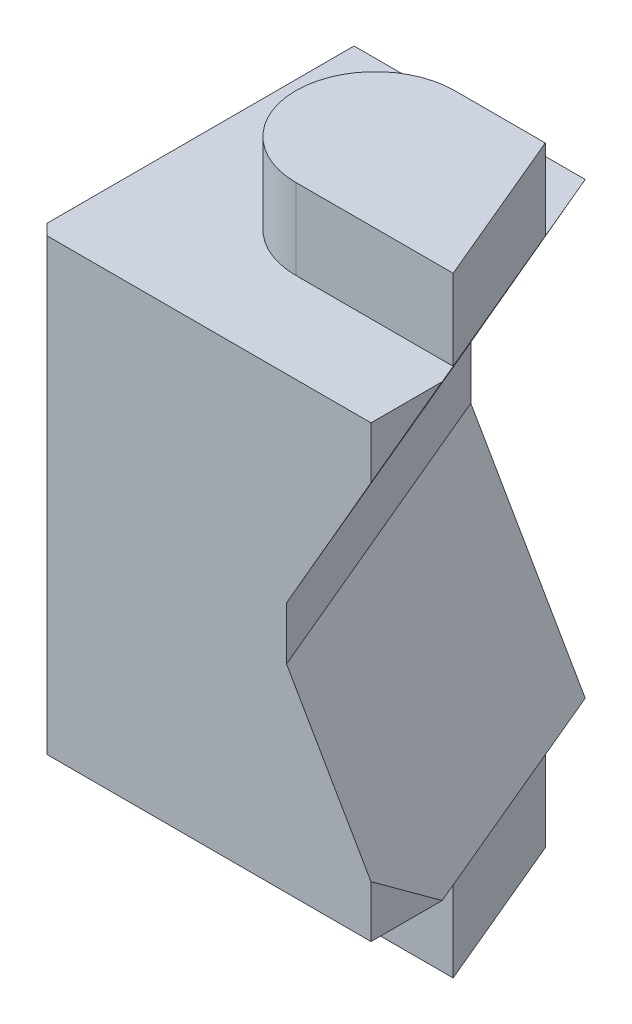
ISO-10303-21;
HEADER;
FILE_DESCRIPTION(('STEP AP214'),'2;1');
FILE_NAME('part.step','',(''),(''),'','','');
FILE_SCHEMA(('AUTOMOTIVE_DESIGN { 1 0 10303 214 1 1 1 1 }'));
ENDSEC;
DATA;
#1=APPLICATION_CONTEXT('core data for automotive mechanical design processes');
#2=APPLICATION_PROTOCOL_DEFINITION('international standard','automotive_design',2000,#1);
#3=PRODUCT_CONTEXT('',#1,'mechanical');
#4=PRODUCT('Part','Part','',(#3));
#5=PRODUCT_RELATED_PRODUCT_CATEGORY('part','',(#4));
#6=PRODUCT_DEFINITION_FORMATION('','',#4);
#7=PRODUCT_DEFINITION_CONTEXT('part definition',#1,'design');
#8=PRODUCT_DEFINITION('design','',#6,#7);
#9=PRODUCT_DEFINITION_SHAPE('','',#8);
#10=(LENGTH_UNIT() NAMED_UNIT(*) SI_UNIT(.MILLI.,.METRE.));
#11=(NAMED_UNIT(*) PLANE_ANGLE_UNIT() SI_UNIT($,.RADIAN.));
#12=(NAMED_UNIT(*) SI_UNIT($,.STERADIAN.) SOLID_ANGLE_UNIT());
#13=UNCERTAINTY_MEASURE_WITH_UNIT(LENGTH_MEASURE(1.E-05),#10,'distance_accuracy_value','');
#14=(GEOMETRIC_REPRESENTATION_CONTEXT(3) GLOBAL_UNCERTAINTY_ASSIGNED_CONTEXT((#13)) GLOBAL_UNIT_ASSIGNED_CONTEXT((#10,
#11,#12)) REPRESENTATION_CONTEXT('',''));
#15=CARTESIAN_POINT('',(0.,0.,0.));
#16=DIRECTION('',(0.,0.,1.));
#17=DIRECTION('',(1.,0.,0.));
#18=AXIS2_PLACEMENT_3D('',#15,#16,#17);
#19=CARTESIAN_POINT('',(-3.,0.,-7.5));
#20=DIRECTION('',(-1.,0.,0.));
#21=DIRECTION('',(0.,0.721350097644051,-0.692570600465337));
#22=AXIS2_PLACEMENT_3D('',#19,#20,#21);
#23=CYLINDRICAL_SURFACE('',#22,5.);
#24=CARTESIAN_POINT('',(-4.,0.,-7.5));
#25=DIRECTION('',(-1.,0.,0.));
#26=DIRECTION('',(0.,0.721350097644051,-0.692570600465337));
#27=AXIS2_PLACEMENT_3D('',#24,#25,#26);
#28=CIRCLE('',#27,5.);
#29=CARTESIAN_POINT('',(-4.00000000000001,3.60675048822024,-10.9628530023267));
#30=VERTEX_POINT('',#29);
#31=EDGE_CURVE('E282',#30,#30,#28,.T.);
#32=ORIENTED_EDGE('',*,*,#31,.T.);
#33=EDGE_LOOP('',(#32));
#34=FACE_BOUND('',#33,.T.);
#35=CARTESIAN_POINT('',(-4.6,0.,-7.5));
#36=DIRECTION('',(-1.,0.,0.));
#37=DIRECTION('',(0.,0.,1.));
#38=AXIS2_PLACEMENT_3D('',#35,#36,#37);
#39=CIRCLE('',#38,5.);
#40=CARTESIAN_POINT('',(-4.60000000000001,0.,-2.5));
#41=VERTEX_POINT('',#40);
#42=EDGE_CURVE('E284',#41,#41,#39,.T.);
#43=ORIENTED_EDGE('',*,*,#42,.F.);
#44=EDGE_LOOP('',(#43));
#45=FACE_BOUND('',#44,.T.);
#46=ADVANCED_FACE('F14',(#34,#45),#23,.T.);
#47=CARTESIAN_POINT('',(-2.99999999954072,0.,-7.5));
#48=DIRECTION('',(1.,0.,0.));
#49=DIRECTION('',(0.,-0.721350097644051,0.692570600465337));
#50=AXIS2_PLACEMENT_3D('',#47,#48,#49);
#51=CONICAL_SURFACE('',#50,5.99999999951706,0.785398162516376);
#52=CARTESIAN_POINT('',(-3.,0.,-7.5));
#53=DIRECTION('',(1.,0.,0.));
#54=DIRECTION('',(0.,0.,-1.));
#55=AXIS2_PLACEMENT_3D('',#52,#53,#54);
#56=CIRCLE('',#55,5.99999999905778);
#57=CARTESIAN_POINT('',(-3.,0.,-13.4999999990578));
#58=VERTEX_POINT('',#57);
#59=EDGE_CURVE('E9',#58,#58,#56,.T.);
#60=ORIENTED_EDGE('',*,*,#59,.F.);
#61=EDGE_LOOP('',(#60));
#62=FACE_BOUND('',#61,.T.);
#63=ORIENTED_EDGE('',*,*,#31,.F.);
#64=EDGE_LOOP('',(#63));
#65=FACE_BOUND('',#64,.T.);
#66=ADVANCED_FACE('F310',(#62,#65),#51,.T.);
#67=CARTESIAN_POINT('',(6.8,-14.4,-5.8));
#68=DIRECTION('',(0.,-1.,0.));
#69=DIRECTION('',(-1.,0.,0.));
#70=AXIS2_PLACEMENT_3D('',#67,#68,#69);
#71=PLANE('',#70);
#72=CARTESIAN_POINT('',(5.,-14.4,-8.));
#73=DIRECTION('',(0.,1.,0.));
#74=DIRECTION('',(-1.,0.,0.));
#75=AXIS2_PLACEMENT_3D('',#72,#73,#74);
#76=CIRCLE('',#75,3.75);
#77=CARTESIAN_POINT('',(5.,-14.4,-11.75));
#78=VERTEX_POINT('',#77);
#79=CARTESIAN_POINT('',(5.,-14.4,-4.25));
#80=VERTEX_POINT('',#79);
#81=EDGE_CURVE('E166',#78,#80,#76,.T.);
#82=ORIENTED_EDGE('',*,*,#81,.F.);
#83=DIRECTION('',(-1.,0.,0.));
#84=VECTOR('',#83,1.);
#85=CARTESIAN_POINT('',(5.,-14.4,-11.75));
#86=LINE('',#85,#84);
#87=CARTESIAN_POINT('',(9.27389168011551,-14.4,-11.75));
#88=VERTEX_POINT('',#87);
#89=EDGE_CURVE('E138',#88,#78,#86,.T.);
#90=ORIENTED_EDGE('',*,*,#89,.F.);
#91=DIRECTION('',(-0.387449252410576,0.,-0.921891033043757));
#92=VECTOR('',#91,1.);
#93=CARTESIAN_POINT('',(12.4259663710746,-14.4,-4.25));
#94=LINE('',#93,#92);
#95=CARTESIAN_POINT('',(12.4259663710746,-14.4,-4.25));
#96=VERTEX_POINT('',#95);
#97=EDGE_CURVE('E170',#96,#88,#94,.T.);
#98=ORIENTED_EDGE('',*,*,#97,.F.);
#99=DIRECTION('',(1.,0.,0.));
#100=VECTOR('',#99,1.);
#101=CARTESIAN_POINT('',(5.,-14.4,-4.25));
#102=LINE('',#101,#100);
#103=EDGE_CURVE('E153',#80,#96,#102,.T.);
#104=ORIENTED_EDGE('',*,*,#103,.F.);
#105=EDGE_LOOP('',(#82,#90,#98,#104));
#106=FACE_BOUND('',#105,.T.);
#107=ADVANCED_FACE('F312',(#106),#71,.T.);
#108=CARTESIAN_POINT('',(12.4259663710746,-10.6,-4.25));
#109=DIRECTION('',(-0.921891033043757,0.,0.387449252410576));
#110=DIRECTION('',(0.387449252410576,0.,0.921891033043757));
#111=AXIS2_PLACEMENT_3D('',#108,#109,#110);
#112=PLANE('',#111);
#113=ORIENTED_EDGE('',*,*,#97,.T.);
#114=DIRECTION('',(0.,-1.,0.));
#115=VECTOR('',#114,1.);
#116=CARTESIAN_POINT('',(9.2738916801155,-10.6,-11.75));
#117=LINE('',#116,#115);
#118=CARTESIAN_POINT('',(9.27389168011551,-10.6,-11.75));
#119=VERTEX_POINT('',#118);
#120=EDGE_CURVE('E142',#119,#88,#117,.T.);
#121=ORIENTED_EDGE('',*,*,#120,.F.);
#122=DIRECTION('',(-0.387449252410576,0.,-0.921891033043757));
#123=VECTOR('',#122,1.);
#124=CARTESIAN_POINT('',(12.4259663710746,-10.6,-4.25));
#125=LINE('',#124,#123);
#126=CARTESIAN_POINT('',(12.4259663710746,-10.6,-4.25));
#127=VERTEX_POINT('',#126);
#128=EDGE_CURVE('E160',#127,#119,#125,.T.);
#129=ORIENTED_EDGE('',*,*,#128,.F.);
#130=DIRECTION('',(0.,-1.,0.));
#131=VECTOR('',#130,1.);
#132=CARTESIAN_POINT('',(12.4259663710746,-10.6,-4.25));
#133=LINE('',#132,#131);
#134=EDGE_CURVE('E175',#127,#96,#133,.T.);
#135=ORIENTED_EDGE('',*,*,#134,.T.);
#136=EDGE_LOOP('',(#113,#121,#129,#135));
#137=FACE_BOUND('',#136,.T.);
#138=ADVANCED_FACE('F322',(#137),#112,.F.);
#139=CARTESIAN_POINT('',(12.4259663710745,10.6,-4.25));
#140=DIRECTION('',(0.921891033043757,0.,-0.387449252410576));
#141=DIRECTION('',(-0.387449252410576,0.,-0.921891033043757));
#142=AXIS2_PLACEMENT_3D('',#139,#140,#141);
#143=PLANE('',#142);
#144=DIRECTION('',(-0.387449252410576,0.,-0.921891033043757));
#145=VECTOR('',#144,1.);
#146=CARTESIAN_POINT('',(12.4259663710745,14.4,-4.25));
#147=LINE('',#146,#145);
#148=CARTESIAN_POINT('',(12.4259663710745,14.4,-4.25));
#149=VERTEX_POINT('',#148);
#150=CARTESIAN_POINT('',(9.27389168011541,14.4,-11.75));
#151=VERTEX_POINT('',#150);
#152=EDGE_CURVE('E196',#149,#151,#147,.T.);
#153=ORIENTED_EDGE('',*,*,#152,.F.);
#154=DIRECTION('',(0.,1.,0.));
#155=VECTOR('',#154,1.);
#156=CARTESIAN_POINT('',(12.4259663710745,10.6,-4.25));
#157=LINE('',#156,#155);
#158=CARTESIAN_POINT('',(12.4259663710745,10.6,-4.25));
#159=VERTEX_POINT('',#158);
#160=EDGE_CURVE('E206',#159,#149,#157,.T.);
#161=ORIENTED_EDGE('',*,*,#160,.F.);
#162=DIRECTION('',(-0.387449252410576,0.,-0.921891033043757));
#163=VECTOR('',#162,1.);
#164=CARTESIAN_POINT('',(12.4259663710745,10.6,-4.25));
#165=LINE('',#164,#163);
#166=CARTESIAN_POINT('',(9.27389168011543,10.6,-11.75));
#167=VERTEX_POINT('',#166);
#168=EDGE_CURVE('E184',#159,#167,#165,.T.);
#169=ORIENTED_EDGE('',*,*,#168,.T.);
#170=DIRECTION('',(0.,1.,0.));
#171=VECTOR('',#170,1.);
#172=CARTESIAN_POINT('',(9.27389168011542,10.6,-11.75));
#173=LINE('',#172,#171);
#174=EDGE_CURVE('E204',#167,#151,#173,.T.);
#175=ORIENTED_EDGE('',*,*,#174,.T.);
#176=EDGE_LOOP('',(#153,#161,#169,#175));
#177=FACE_BOUND('',#176,.T.);
#178=ADVANCED_FACE('F328',(#177),#143,.T.);
#179=CARTESIAN_POINT('',(4.98939776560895,14.4,-8.));
#180=DIRECTION('',(0.,1.,0.));
#181=DIRECTION('',(-1.,0.,0.));
#182=AXIS2_PLACEMENT_3D('',#179,#180,#181);
#183=PLANE('',#182);
#184=CARTESIAN_POINT('',(5.,14.4,-8.));
#185=DIRECTION('',(0.,1.,0.));
#186=DIRECTION('',(-1.,0.,0.));
#187=AXIS2_PLACEMENT_3D('',#184,#185,#186);
#188=CIRCLE('',#187,3.75);
#189=CARTESIAN_POINT('',(5.,14.4,-11.75));
#190=VERTEX_POINT('',#189);
#191=CARTESIAN_POINT('',(5.,14.4,-4.25));
#192=VERTEX_POINT('',#191);
#193=EDGE_CURVE('E174',#190,#192,#188,.T.);
#194=ORIENTED_EDGE('',*,*,#193,.T.);
#195=DIRECTION('',(1.,0.,0.));
#196=VECTOR('',#195,1.);
#197=CARTESIAN_POINT('',(5.,14.4,-4.25));
#198=LINE('',#197,#196);
#199=EDGE_CURVE('E193',#192,#149,#198,.T.);
#200=ORIENTED_EDGE('',*,*,#199,.T.);
#201=ORIENTED_EDGE('',*,*,#152,.T.);
#202=DIRECTION('',(-1.,0.,0.));
#203=VECTOR('',#202,1.);
#204=CARTESIAN_POINT('',(5.,14.4,-11.75));
#205=LINE('',#204,#203);
#206=EDGE_CURVE('E181',#151,#190,#205,.T.);
#207=ORIENTED_EDGE('',*,*,#206,.T.);
#208=EDGE_LOOP('',(#194,#200,#201,#207));
#209=FACE_BOUND('',#208,.T.);
#210=ADVANCED_FACE('F332',(#209),#183,.T.);
#211=CARTESIAN_POINT('',(5.,-10.6,-11.75));
#212=DIRECTION('',(0.,0.,1.));
#213=DIRECTION('',(1.,0.,0.));
#214=AXIS2_PLACEMENT_3D('',#211,#212,#213);
#215=PLANE('',#214);
#216=ORIENTED_EDGE('',*,*,#89,.T.);
#217=DIRECTION('',(0.,-1.,0.));
#218=VECTOR('',#217,1.);
#219=CARTESIAN_POINT('',(5.,-10.6,-11.75));
#220=LINE('',#219,#218);
#221=CARTESIAN_POINT('',(5.,-10.6,-11.75));
#222=VERTEX_POINT('',#221);
#223=EDGE_CURVE('E134',#222,#78,#220,.T.);
#224=ORIENTED_EDGE('',*,*,#223,.F.);
#225=DIRECTION('',(-1.,0.,0.));
#226=VECTOR('',#225,1.);
#227=CARTESIAN_POINT('',(5.,-10.6,-11.75));
#228=LINE('',#227,#226);
#229=EDGE_CURVE('E31',#119,#222,#228,.T.);
#230=ORIENTED_EDGE('',*,*,#229,.F.);
#231=ORIENTED_EDGE('',*,*,#120,.T.);
#232=EDGE_LOOP('',(#216,#224,#230,#231));
#233=FACE_BOUND('',#232,.T.);
#234=ADVANCED_FACE('F136',(#233),#215,.F.);
#235=CARTESIAN_POINT('',(12.8,0.,-7.35));
#236=DIRECTION('',(1.,0.,0.));
#237=DIRECTION('',(0.,1.,0.));
#238=AXIS2_PLACEMENT_3D('',#235,#236,#237);
#239=PLANE('',#238);
#240=DIRECTION('',(0.,0.,1.));
#241=VECTOR('',#240,1.);
#242=CARTESIAN_POINT('',(12.8,-10.6,-7.35));
#243=LINE('',#242,#241);
#244=CARTESIAN_POINT('',(12.8,-10.6,0.));
#245=VERTEX_POINT('',#244);
#246=CARTESIAN_POINT('',(12.8,-10.6,-3.36002990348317));
#247=VERTEX_POINT('',#246);
#248=EDGE_CURVE('E268',#245,#247,#243,.F.);
#249=ORIENTED_EDGE('',*,*,#248,.T.);
#250=DIRECTION('',(0.,-0.588524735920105,-0.808479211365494));
#251=VECTOR('',#250,1.);
#252=CARTESIAN_POINT('',(12.8,-8.15409825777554,0.));
#253=LINE('',#252,#251);
#254=CARTESIAN_POINT('',(12.8,-8.15409825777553,0.));
#255=VERTEX_POINT('',#254);
#256=EDGE_CURVE('E265',#255,#247,#253,.T.);
#257=ORIENTED_EDGE('',*,*,#256,.F.);
#258=DIRECTION('',(0.,1.,0.));
#259=VECTOR('',#258,1.);
#260=CARTESIAN_POINT('',(12.8,0.,0.));
#261=LINE('',#260,#259);
#262=EDGE_CURVE('E223',#245,#255,#261,.T.);
#263=ORIENTED_EDGE('',*,*,#262,.F.);
#264=EDGE_LOOP('',(#249,#257,#263));
#265=FACE_BOUND('',#264,.T.);
#266=ADVANCED_FACE('F352',(#265),#239,.T.);
#267=CARTESIAN_POINT('',(5.,-10.6,-4.25));
#268=DIRECTION('',(0.,0.,-1.));
#269=DIRECTION('',(-1.,0.,0.));
#270=AXIS2_PLACEMENT_3D('',#267,#268,#269);
#271=PLANE('',#270);
#272=ORIENTED_EDGE('',*,*,#103,.T.);
#273=ORIENTED_EDGE('',*,*,#134,.F.);
#274=DIRECTION('',(1.,0.,0.));
#275=VECTOR('',#274,1.);
#276=CARTESIAN_POINT('',(5.,-10.6,-4.25));
#277=LINE('',#276,#275);
#278=CARTESIAN_POINT('',(5.,-10.6,-4.25));
#279=VERTEX_POINT('',#278);
#280=EDGE_CURVE('E143',#279,#127,#277,.T.);
#281=ORIENTED_EDGE('',*,*,#280,.F.);
#282=DIRECTION('',(0.,-1.,0.));
#283=VECTOR('',#282,1.);
#284=CARTESIAN_POINT('',(5.,-10.6,-4.25));
#285=LINE('',#284,#283);
#286=EDGE_CURVE('E150',#279,#80,#285,.T.);
#287=ORIENTED_EDGE('',*,*,#286,.T.);
#288=EDGE_LOOP('',(#272,#273,#281,#287));
#289=FACE_BOUND('',#288,.T.);
#290=ADVANCED_FACE('F350',(#289),#271,.F.);
#291=CARTESIAN_POINT('',(5.,-10.6,-8.));
#292=DIRECTION('',(0.,-1.,0.));
#293=DIRECTION('',(1.,0.,0.));
#294=AXIS2_PLACEMENT_3D('',#291,#292,#293);
#295=CYLINDRICAL_SURFACE('',#294,3.75);
#296=ORIENTED_EDGE('',*,*,#81,.T.);
#297=ORIENTED_EDGE('',*,*,#286,.F.);
#298=CARTESIAN_POINT('',(5.,-10.6,-8.));
#299=DIRECTION('',(0.,1.,0.));
#300=DIRECTION('',(-1.,0.,0.));
#301=AXIS2_PLACEMENT_3D('',#298,#299,#300);
#302=CIRCLE('',#301,3.75);
#303=EDGE_CURVE('E147',#222,#279,#302,.T.);
#304=ORIENTED_EDGE('',*,*,#303,.F.);
#305=ORIENTED_EDGE('',*,*,#223,.T.);
#306=EDGE_LOOP('',(#296,#297,#304,#305));
#307=FACE_BOUND('',#306,.T.);
#308=ADVANCED_FACE('F148',(#307),#295,.T.);
#309=CARTESIAN_POINT('',(2.84556260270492,3.73713063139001,-7.35));
#310=DIRECTION('',(0.813797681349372,0.469846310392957,-0.342020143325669));
#311=DIRECTION('',(-0.5,0.866025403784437,0.));
#312=AXIS2_PLACEMENT_3D('',#309,#310,#311);
#313=PLANE('',#312);
#314=DIRECTION('',(-0.5,0.866025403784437,0.));
#315=VECTOR('',#314,1.);
#316=CARTESIAN_POINT('',(0.434225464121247,2.34494448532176,-15.));
#317=LINE('',#316,#315);
#318=CARTESIAN_POINT('',(7.90799264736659,-10.6,-15.));
#319=VERTEX_POINT('',#318);
#320=CARTESIAN_POINT('',(2.50847221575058,-1.2477562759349,-15.));
#321=VERTEX_POINT('',#320);
#322=EDGE_CURVE('E260',#319,#321,#317,.T.);
#323=ORIENTED_EDGE('',*,*,#322,.T.);
#324=DIRECTION('',(-0.387515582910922,0.000135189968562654,-0.921863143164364));
#325=VECTOR('',#324,1.);
#326=CARTESIAN_POINT('',(8.81389161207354,-1.24995600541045,0.));
#327=LINE('',#326,#325);
#328=CARTESIAN_POINT('',(8.81389161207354,-1.24995600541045,0.));
#329=VERTEX_POINT('',#328);
#330=EDGE_CURVE('E257',#329,#321,#327,.T.);
#331=ORIENTED_EDGE('',*,*,#330,.F.);
#332=DIRECTION('',(-0.5,0.866025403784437,0.));
#333=VECTOR('',#332,1.);
#334=CARTESIAN_POINT('',(12.8,-8.15409825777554,0.));
#335=LINE('',#334,#333);
#336=EDGE_CURVE('E220',#255,#329,#335,.T.);
#337=ORIENTED_EDGE('',*,*,#336,.F.);
#338=ORIENTED_EDGE('',*,*,#256,.T.);
#339=DIRECTION('',(-0.387449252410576,0.,-0.921891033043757));
#340=VECTOR('',#339,1.);
#341=CARTESIAN_POINT('',(12.8,-10.6,-3.36002990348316));
#342=LINE('',#341,#340);
#343=EDGE_CURVE('E262',#247,#127,#342,.T.);
#344=ORIENTED_EDGE('',*,*,#343,.T.);
#345=ORIENTED_EDGE('',*,*,#128,.T.);
#346=EDGE_CURVE('E158',#119,#319,#342,.T.);
#347=ORIENTED_EDGE('',*,*,#346,.T.);
#348=EDGE_LOOP('',(#323,#331,#337,#338,#344,#345,#347));
#349=FACE_BOUND('',#348,.T.);
#350=ADVANCED_FACE('F359',(#349),#313,.T.);
#351=CARTESIAN_POINT('',(5.72423610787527,5.925,-7.35));
#352=DIRECTION('',(0.921863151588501,0.,-0.387515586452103));
#353=DIRECTION('',(-0.387515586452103,0.,-0.921863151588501));
#354=AXIS2_PLACEMENT_3D('',#351,#352,#353);
#355=PLANE('',#354);
#356=DIRECTION('',(0.,1.,0.));
#357=VECTOR('',#356,1.);
#358=CARTESIAN_POINT('',(2.50847221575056,5.925,-15.));
#359=LINE('',#358,#357);
#360=CARTESIAN_POINT('',(2.50847221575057,1.24775627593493,-15.));
#361=VERTEX_POINT('',#360);
#362=EDGE_CURVE('E255',#321,#361,#359,.T.);
#363=ORIENTED_EDGE('',*,*,#362,.T.);
#364=DIRECTION('',(-0.387515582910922,-0.000135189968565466,-0.921863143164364));
#365=VECTOR('',#364,1.);
#366=CARTESIAN_POINT('',(8.81389161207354,1.24995600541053,0.));
#367=LINE('',#366,#365);
#368=CARTESIAN_POINT('',(8.81389161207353,1.24995600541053,0.));
#369=VERTEX_POINT('',#368);
#370=EDGE_CURVE('E252',#369,#361,#367,.T.);
#371=ORIENTED_EDGE('',*,*,#370,.F.);
#372=DIRECTION('',(0.,1.,0.));
#373=VECTOR('',#372,1.);
#374=CARTESIAN_POINT('',(8.81389161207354,0.,0.));
#375=LINE('',#374,#373);
#376=EDGE_CURVE('E217',#329,#369,#375,.T.);
#377=ORIENTED_EDGE('',*,*,#376,.F.);
#378=ORIENTED_EDGE('',*,*,#330,.T.);
#379=EDGE_LOOP('',(#363,#371,#377,#378));
#380=FACE_BOUND('',#379,.T.);
#381=ADVANCED_FACE('F377',(#380),#355,.T.);
#382=CARTESIAN_POINT('',(5.,10.6,-8.));
#383=DIRECTION('',(0.,1.,0.));
#384=DIRECTION('',(-1.,0.,0.));
#385=AXIS2_PLACEMENT_3D('',#382,#383,#384);
#386=CYLINDRICAL_SURFACE('',#385,3.75);
#387=ORIENTED_EDGE('',*,*,#193,.F.);
#388=DIRECTION('',(0.,1.,0.));
#389=VECTOR('',#388,1.);
#390=CARTESIAN_POINT('',(5.,10.6,-11.75));
#391=LINE('',#390,#389);
#392=CARTESIAN_POINT('',(5.,10.6,-11.75));
#393=VERTEX_POINT('',#392);
#394=EDGE_CURVE('E201',#393,#190,#391,.T.);
#395=ORIENTED_EDGE('',*,*,#394,.F.);
#396=CARTESIAN_POINT('',(5.,10.6,-8.));
#397=DIRECTION('',(0.,1.,0.));
#398=DIRECTION('',(-1.,0.,0.));
#399=AXIS2_PLACEMENT_3D('',#396,#397,#398);
#400=CIRCLE('',#399,3.75);
#401=CARTESIAN_POINT('',(5.,10.6,-4.25));
#402=VERTEX_POINT('',#401);
#403=EDGE_CURVE('E39',#393,#402,#400,.T.);
#404=ORIENTED_EDGE('',*,*,#403,.T.);
#405=DIRECTION('',(0.,1.,0.));
#406=VECTOR('',#405,1.);
#407=CARTESIAN_POINT('',(5.,10.6,-4.25));
#408=LINE('',#407,#406);
#409=EDGE_CURVE('E190',#402,#192,#408,.T.);
#410=ORIENTED_EDGE('',*,*,#409,.T.);
#411=EDGE_LOOP('',(#387,#395,#404,#410));
#412=FACE_BOUND('',#411,.T.);
#413=ADVANCED_FACE('F373',(#412),#386,.T.);
#414=CARTESIAN_POINT('',(5.,10.6,-4.25));
#415=DIRECTION('',(0.,0.,1.));
#416=DIRECTION('',(1.,0.,0.));
#417=AXIS2_PLACEMENT_3D('',#414,#415,#416);
#418=PLANE('',#417);
#419=ORIENTED_EDGE('',*,*,#199,.F.);
#420=ORIENTED_EDGE('',*,*,#409,.F.);
#421=DIRECTION('',(1.,0.,0.));
#422=VECTOR('',#421,1.);
#423=CARTESIAN_POINT('',(5.,10.6,-4.25));
#424=LINE('',#423,#422);
#425=EDGE_CURVE('E180',#402,#159,#424,.T.);
#426=ORIENTED_EDGE('',*,*,#425,.T.);
#427=ORIENTED_EDGE('',*,*,#160,.T.);
#428=EDGE_LOOP('',(#419,#420,#426,#427));
#429=FACE_BOUND('',#428,.T.);
#430=ADVANCED_FACE('F369',(#429),#418,.T.);
#431=CARTESIAN_POINT('',(12.8,0.,-7.35));
#432=DIRECTION('',(1.,0.,0.));
#433=DIRECTION('',(0.,1.,0.));
#434=AXIS2_PLACEMENT_3D('',#431,#432,#433);
#435=PLANE('',#434);
#436=DIRECTION('',(0.,0.588524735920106,-0.808479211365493));
#437=VECTOR('',#436,1.);
#438=CARTESIAN_POINT('',(12.8,8.15409825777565,0.));
#439=LINE('',#438,#437);
#440=CARTESIAN_POINT('',(12.8,8.15409825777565,0.));
#441=VERTEX_POINT('',#440);
#442=CARTESIAN_POINT('',(12.8,10.6,-3.36002990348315));
#443=VERTEX_POINT('',#442);
#444=EDGE_CURVE('E247',#441,#443,#439,.T.);
#445=ORIENTED_EDGE('',*,*,#444,.T.);
#446=DIRECTION('',(0.,0.,1.));
#447=VECTOR('',#446,1.);
#448=CARTESIAN_POINT('',(12.8,10.6,0.3));
#449=LINE('',#448,#447);
#450=CARTESIAN_POINT('',(12.8,10.6,0.));
#451=VERTEX_POINT('',#450);
#452=EDGE_CURVE('E241',#451,#443,#449,.F.);
#453=ORIENTED_EDGE('',*,*,#452,.F.);
#454=DIRECTION('',(0.,1.,0.));
#455=VECTOR('',#454,1.);
#456=CARTESIAN_POINT('',(12.8,0.,0.));
#457=LINE('',#456,#455);
#458=EDGE_CURVE('E211',#441,#451,#457,.T.);
#459=ORIENTED_EDGE('',*,*,#458,.F.);
#460=EDGE_LOOP('',(#445,#453,#459));
#461=FACE_BOUND('',#460,.T.);
#462=ADVANCED_FACE('F372',(#461),#435,.T.);
#463=CARTESIAN_POINT('',(6.0259326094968,0.,0.));
#464=DIRECTION('',(0.,0.,1.));
#465=DIRECTION('',(1.,0.,0.));
#466=AXIS2_PLACEMENT_3D('',#463,#464,#465);
#467=PLANE('',#466);
#468=ORIENTED_EDGE('',*,*,#458,.T.);
#469=DIRECTION('',(1.,0.,0.));
#470=VECTOR('',#469,1.);
#471=CARTESIAN_POINT('',(6.02593260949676,10.6,0.));
#472=LINE('',#471,#470);
#473=CARTESIAN_POINT('',(-2.50000000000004,10.6,0.));
#474=VERTEX_POINT('',#473);
#475=EDGE_CURVE('E23',#451,#474,#472,.F.);
#476=ORIENTED_EDGE('',*,*,#475,.T.);
#477=DIRECTION('',(0.,1.,0.));
#478=VECTOR('',#477,1.);
#479=CARTESIAN_POINT('',(-2.5,0.,0.));
#480=LINE('',#479,#478);
#481=CARTESIAN_POINT('',(-2.49999999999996,-10.6,0.));
#482=VERTEX_POINT('',#481);
#483=EDGE_CURVE('E229',#474,#482,#480,.F.);
#484=ORIENTED_EDGE('',*,*,#483,.T.);
#485=DIRECTION('',(1.,0.,0.));
#486=VECTOR('',#485,1.);
#487=CARTESIAN_POINT('',(6.02593260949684,-10.6,0.));
#488=LINE('',#487,#486);
#489=EDGE_CURVE('E226',#482,#245,#488,.T.);
#490=ORIENTED_EDGE('',*,*,#489,.T.);
#491=ORIENTED_EDGE('',*,*,#262,.T.);
#492=ORIENTED_EDGE('',*,*,#336,.T.);
#493=ORIENTED_EDGE('',*,*,#376,.T.);
#494=DIRECTION('',(0.5,0.866025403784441,0.));
#495=VECTOR('',#494,1.);
#496=CARTESIAN_POINT('',(8.81389161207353,1.24995600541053,0.));
#497=LINE('',#496,#495);
#498=EDGE_CURVE('E214',#369,#441,#497,.T.);
#499=ORIENTED_EDGE('',*,*,#498,.T.);
#500=EDGE_LOOP('',(#468,#476,#484,#490,#491,#492,#493,#499));
#501=FACE_BOUND('',#500,.T.);
#502=ADVANCED_FACE('F379',(#501),#467,.T.);
#503=CARTESIAN_POINT('',(9.36549724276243,7.55572742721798,-7.35));
#504=DIRECTION('',(0.813797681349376,-0.469846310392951,-0.342020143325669));
#505=DIRECTION('',(0.5,0.866025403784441,0.));
#506=AXIS2_PLACEMENT_3D('',#503,#504,#505);
#507=PLANE('',#506);
#508=DIRECTION('',(-0.387449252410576,0.,-0.921891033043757));
#509=VECTOR('',#508,1.);
#510=CARTESIAN_POINT('',(12.8,10.6,-3.36002990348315));
#511=LINE('',#510,#509);
#512=EDGE_CURVE('E238',#443,#159,#511,.T.);
#513=ORIENTED_EDGE('',*,*,#512,.F.);
#514=ORIENTED_EDGE('',*,*,#444,.F.);
#515=ORIENTED_EDGE('',*,*,#498,.F.);
#516=ORIENTED_EDGE('',*,*,#370,.T.);
#517=DIRECTION('',(0.5,0.866025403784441,0.));
#518=VECTOR('',#517,1.);
#519=CARTESIAN_POINT('',(6.95416010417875,8.94791357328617,-15.));
#520=LINE('',#519,#518);
#521=CARTESIAN_POINT('',(7.9079926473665,10.6,-15.));
#522=VERTEX_POINT('',#521);
#523=EDGE_CURVE('E249',#361,#522,#520,.T.);
#524=ORIENTED_EDGE('',*,*,#523,.T.);
#525=EDGE_CURVE('E240',#167,#522,#511,.T.);
#526=ORIENTED_EDGE('',*,*,#525,.F.);
#527=ORIENTED_EDGE('',*,*,#168,.F.);
#528=EDGE_LOOP('',(#513,#514,#515,#516,#524,#526,#527));
#529=FACE_BOUND('',#528,.T.);
#530=ADVANCED_FACE('F364',(#529),#507,.T.);
#531=CARTESIAN_POINT('',(5.,10.6,-11.75));
#532=DIRECTION('',(0.,0.,-1.));
#533=DIRECTION('',(-1.,0.,0.));
#534=AXIS2_PLACEMENT_3D('',#531,#532,#533);
#535=PLANE('',#534);
#536=ORIENTED_EDGE('',*,*,#206,.F.);
#537=ORIENTED_EDGE('',*,*,#174,.F.);
#538=DIRECTION('',(-1.,0.,0.));
#539=VECTOR('',#538,1.);
#540=CARTESIAN_POINT('',(5.,10.6,-11.75));
#541=LINE('',#540,#539);
#542=EDGE_CURVE('E187',#167,#393,#541,.T.);
#543=ORIENTED_EDGE('',*,*,#542,.T.);
#544=ORIENTED_EDGE('',*,*,#394,.T.);
#545=EDGE_LOOP('',(#536,#537,#543,#544));
#546=FACE_BOUND('',#545,.T.);
#547=ADVANCED_FACE('F360',(#546),#535,.T.);
#548=CARTESIAN_POINT('',(-2.75,0.,-0.25));
#549=DIRECTION('',(-0.707106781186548,0.,0.707106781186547));
#550=DIRECTION('',(0.707106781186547,0.,0.707106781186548));
#551=AXIS2_PLACEMENT_3D('',#548,#549,#550);
#552=PLANE('',#551);
#553=DIRECTION('',(0.707106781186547,0.,0.707106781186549));
#554=VECTOR('',#553,1.);
#555=CARTESIAN_POINT('',(-3.00000000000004,10.6,-0.5));
#556=LINE('',#555,#554);
#557=CARTESIAN_POINT('',(-3.00000000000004,10.6,-0.5));
#558=VERTEX_POINT('',#557);
#559=EDGE_CURVE('E244',#558,#474,#556,.T.);
#560=ORIENTED_EDGE('',*,*,#559,.F.);
#561=DIRECTION('',(0.,1.,0.));
#562=VECTOR('',#561,1.);
#563=CARTESIAN_POINT('',(-3.,0.,-0.5));
#564=LINE('',#563,#562);
#565=CARTESIAN_POINT('',(-2.99999999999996,-10.6,-0.5));
#566=VERTEX_POINT('',#565);
#567=EDGE_CURVE('E278',#558,#566,#564,.F.);
#568=ORIENTED_EDGE('',*,*,#567,.T.);
#569=DIRECTION('',(-0.707106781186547,0.,-0.707106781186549));
#570=VECTOR('',#569,1.);
#571=CARTESIAN_POINT('',(-2.49999999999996,-10.6,0.));
#572=LINE('',#571,#570);
#573=EDGE_CURVE('E275',#482,#566,#572,.T.);
#574=ORIENTED_EDGE('',*,*,#573,.F.);
#575=ORIENTED_EDGE('',*,*,#483,.F.);
#576=EDGE_LOOP('',(#560,#568,#574,#575));
#577=FACE_BOUND('',#576,.T.);
#578=ADVANCED_FACE('F363',(#577),#552,.T.);
#579=CARTESIAN_POINT('',(0.,-10.6,-15.));
#580=DIRECTION('',(0.,-1.,0.));
#581=DIRECTION('',(1.,0.,0.));
#582=AXIS2_PLACEMENT_3D('',#579,#580,#581);
#583=PLANE('',#582);
#584=ORIENTED_EDGE('',*,*,#303,.T.);
#585=ORIENTED_EDGE('',*,*,#280,.T.);
#586=ORIENTED_EDGE('',*,*,#343,.F.);
#587=ORIENTED_EDGE('',*,*,#248,.F.);
#588=ORIENTED_EDGE('',*,*,#489,.F.);
#589=ORIENTED_EDGE('',*,*,#573,.T.);
#590=DIRECTION('',(0.,0.,1.));
#591=VECTOR('',#590,1.);
#592=CARTESIAN_POINT('',(-2.99999999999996,-10.6,-15.));
#593=LINE('',#592,#591);
#594=CARTESIAN_POINT('',(-2.99999999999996,-10.6,-15.));
#595=VERTEX_POINT('',#594);
#596=EDGE_CURVE('E272',#566,#595,#593,.F.);
#597=ORIENTED_EDGE('',*,*,#596,.T.);
#598=DIRECTION('',(1.,0.,0.));
#599=VECTOR('',#598,1.);
#600=CARTESIAN_POINT('',(0.,-10.6,-15.));
#601=LINE('',#600,#599);
#602=EDGE_CURVE('E270',#595,#319,#601,.T.);
#603=ORIENTED_EDGE('',*,*,#602,.T.);
#604=ORIENTED_EDGE('',*,*,#346,.F.);
#605=ORIENTED_EDGE('',*,*,#229,.T.);
#606=EDGE_LOOP('',(#584,#585,#586,#587,#588,#589,#597,#603,#604,#605));
#607=FACE_BOUND('',#606,.T.);
#608=ADVANCED_FACE('F156',(#607),#583,.T.);
#609=CARTESIAN_POINT('',(0.,10.6,-15.));
#610=DIRECTION('',(0.,0.,-1.));
#611=DIRECTION('',(-1.,0.,0.));
#612=AXIS2_PLACEMENT_3D('',#609,#610,#611);
#613=PLANE('',#612);
#614=DIRECTION('',(0.,1.,0.));
#615=VECTOR('',#614,1.);
#616=CARTESIAN_POINT('',(-3.,0.,-15.));
#617=LINE('',#616,#615);
#618=CARTESIAN_POINT('',(-3.00000000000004,10.6,-15.));
#619=VERTEX_POINT('',#618);
#620=EDGE_CURVE('E203',#595,#619,#617,.T.);
#621=ORIENTED_EDGE('',*,*,#620,.T.);
#622=DIRECTION('',(-1.,0.,0.));
#623=VECTOR('',#622,1.);
#624=CARTESIAN_POINT('',(0.,10.6,-15.));
#625=LINE('',#624,#623);
#626=EDGE_CURVE('E235',#522,#619,#625,.T.);
#627=ORIENTED_EDGE('',*,*,#626,.F.);
#628=ORIENTED_EDGE('',*,*,#523,.F.);
#629=ORIENTED_EDGE('',*,*,#362,.F.);
#630=ORIENTED_EDGE('',*,*,#322,.F.);
#631=ORIENTED_EDGE('',*,*,#602,.F.);
#632=EDGE_LOOP('',(#621,#627,#628,#629,#630,#631));
#633=FACE_BOUND('',#632,.T.);
#634=ADVANCED_FACE('F385',(#633),#613,.T.);
#635=CARTESIAN_POINT('',(0.,10.6,0.3));
#636=DIRECTION('',(0.,1.,0.));
#637=DIRECTION('',(-1.,0.,0.));
#638=AXIS2_PLACEMENT_3D('',#635,#636,#637);
#639=PLANE('',#638);
#640=ORIENTED_EDGE('',*,*,#542,.F.);
#641=ORIENTED_EDGE('',*,*,#525,.T.);
#642=ORIENTED_EDGE('',*,*,#626,.T.);
#643=DIRECTION('',(0.,0.,1.));
#644=VECTOR('',#643,1.);
#645=CARTESIAN_POINT('',(-3.00000000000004,10.6,0.3));
#646=LINE('',#645,#644);
#647=EDGE_CURVE('E232',#619,#558,#646,.T.);
#648=ORIENTED_EDGE('',*,*,#647,.T.);
#649=ORIENTED_EDGE('',*,*,#559,.T.);
#650=ORIENTED_EDGE('',*,*,#475,.F.);
#651=ORIENTED_EDGE('',*,*,#452,.T.);
#652=ORIENTED_EDGE('',*,*,#512,.T.);
#653=ORIENTED_EDGE('',*,*,#425,.F.);
#654=ORIENTED_EDGE('',*,*,#403,.F.);
#655=EDGE_LOOP('',(#640,#641,#642,#648,#649,#650,#651,#652,#653,#654));
#656=FACE_BOUND('',#655,.T.);
#657=ADVANCED_FACE('F346',(#656),#639,.T.);
#658=CARTESIAN_POINT('',(-3.,0.,-7.5));
#659=DIRECTION('',(1.,0.,0.));
#660=DIRECTION('',(0.,1.,0.));
#661=AXIS2_PLACEMENT_3D('',#658,#659,#660);
#662=PLANE('',#661);
#663=ORIENTED_EDGE('',*,*,#59,.T.);
#664=EDGE_LOOP('',(#663));
#665=FACE_BOUND('',#664,.T.);
#666=ORIENTED_EDGE('',*,*,#647,.F.);
#667=ORIENTED_EDGE('',*,*,#620,.F.);
#668=ORIENTED_EDGE('',*,*,#596,.F.);
#669=ORIENTED_EDGE('',*,*,#567,.F.);
#670=EDGE_LOOP('',(#666,#667,#668,#669));
#671=FACE_BOUND('',#670,.T.);
#672=ADVANCED_FACE('F318',(#665,#671),#662,.F.);
#673=CARTESIAN_POINT('',(-4.6,0.,-7.5));
#674=DIRECTION('',(-1.,0.,0.));
#675=DIRECTION('',(0.,0.,1.));
#676=AXIS2_PLACEMENT_3D('',#673,#674,#675);
#677=PLANE('',#676);
#678=CARTESIAN_POINT('',(-4.6,0.,-7.5));
#679=DIRECTION('',(-1.,0.,0.));
#680=DIRECTION('',(0.,0.,1.));
#681=AXIS2_PLACEMENT_3D('',#678,#679,#680);
#682=CIRCLE('',#681,4.25);
#683=CARTESIAN_POINT('',(-4.60000000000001,0.,-3.25));
#684=VERTEX_POINT('',#683);
#685=EDGE_CURVE('E288',#684,#684,#682,.T.);
#686=ORIENTED_EDGE('',*,*,#685,.F.);
#687=EDGE_LOOP('',(#686));
#688=FACE_BOUND('',#687,.T.);
#689=ORIENTED_EDGE('',*,*,#42,.T.);
#690=EDGE_LOOP('',(#689));
#691=FACE_BOUND('',#690,.T.);
#692=ADVANCED_FACE('F317',(#688,#691),#677,.T.);
#693=CARTESIAN_POINT('',(-3.24967305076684,0.,-7.5));
#694=DIRECTION('',(-1.,0.,0.));
#695=DIRECTION('',(0.,-0.707106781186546,-0.707106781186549));
#696=AXIS2_PLACEMENT_3D('',#693,#694,#695);
#697=SPHERICAL_SURFACE('',#696,4.25);
#698=CARTESIAN_POINT('',(-3.25,0.,-7.5));
#699=DIRECTION('',(-1.,0.,0.));
#700=DIRECTION('',(0.,0.,1.));
#701=AXIS2_PLACEMENT_3D('',#698,#699,#700);
#702=CIRCLE('',#701,4.24999998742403);
#703=CARTESIAN_POINT('',(-3.24999999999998,-3.00520381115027,-10.5052038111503));
#704=VERTEX_POINT('',#703);
#705=EDGE_CURVE('E168',#704,#704,#702,.F.);
#706=CARTESIAN_POINT('',(-6.,0.,-7.5));
#707=DIRECTION('',(1.,0.,0.));
#708=DIRECTION('',(0.,0.,-1.));
#709=AXIS2_PLACEMENT_3D('',#706,#707,#708);
#710=CIRCLE('',#709,3.24009284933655);
#711=CARTESIAN_POINT('',(-5.99999999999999,-2.29109162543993,-9.79109162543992));
#712=VERTEX_POINT('',#711);
#713=EDGE_CURVE('E292',#712,#712,#710,.T.);
#714=CARTESIAN_POINT('',(-3.24999999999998,-3.00520381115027,-10.5052038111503));
#715=CARTESIAN_POINT('',(-3.28115535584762,-3.00520215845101,-10.505202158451));
#716=CARTESIAN_POINT('',(-3.31231068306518,-3.00495817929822,-10.5049581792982));
#717=CARTESIAN_POINT('',(-3.37460621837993,-3.00398587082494,-10.5039858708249));
#718=CARTESIAN_POINT('',(-3.40574642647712,-3.00325754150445,-10.5032575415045));
#719=CARTESIAN_POINT('',(-3.46799666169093,-3.00131683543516,-10.5013168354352));
#720=CARTESIAN_POINT('',(-3.49910668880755,-3.00010445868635,-10.5001044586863));
#721=CARTESIAN_POINT('',(-3.56128151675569,-2.99719625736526,-10.4971962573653));
#722=CARTESIAN_POINT('',(-3.59234631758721,-2.99550043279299,-10.495500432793));
#723=CARTESIAN_POINT('',(-3.65441566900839,-2.99162615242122,-10.4916261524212));
#724=CARTESIAN_POINT('',(-3.68542021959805,-2.98944769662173,-10.4894476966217));
#725=CARTESIAN_POINT('',(-3.74735407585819,-2.98460920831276,-10.4846092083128));
#726=CARTESIAN_POINT('',(-3.77828338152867,-2.98194917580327,-10.4819491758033));
#727=CARTESIAN_POINT('',(-3.8400517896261,-2.97614882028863,-10.4761488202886));
#728=CARTESIAN_POINT('',(-3.87089089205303,-2.97300849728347,-10.4730084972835));
#729=CARTESIAN_POINT('',(-3.93246397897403,-2.96624907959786,-10.4662490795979));
#730=CARTESIAN_POINT('',(-3.96319796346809,-2.9626299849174,-10.4626299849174));
#731=CARTESIAN_POINT('',(-4.02454595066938,-2.95491477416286,-10.4549147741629));
#732=CARTESIAN_POINT('',(-4.05515995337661,-2.95081865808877,-10.4508186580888));
#733=CARTESIAN_POINT('',(-4.11625317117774,-2.94215138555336,-10.4421513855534));
#734=CARTESIAN_POINT('',(-4.14673238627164,-2.93758022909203,-10.437580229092));
#735=CARTESIAN_POINT('',(-4.20754128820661,-2.92796508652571,-10.4279650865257));
#736=CARTESIAN_POINT('',(-4.23787097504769,-2.92292110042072,-10.4229211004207));
#737=CARTESIAN_POINT('',(-4.29836615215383,-2.91236273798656,-10.4123627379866));
#738=CARTESIAN_POINT('',(-4.3285316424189,-2.90684836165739,-10.4068483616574));
#739=CARTESIAN_POINT('',(-4.38868383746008,-2.89535188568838,-10.3953518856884));
#740=CARTESIAN_POINT('',(-4.41867054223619,-2.88936978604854,-10.3893697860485));
#741=CARTESIAN_POINT('',(-4.4784506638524,-2.87694075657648,-10.3769407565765));
#742=CARTESIAN_POINT('',(-4.50824408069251,-2.87049382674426,-10.3704938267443));
#743=CARTESIAN_POINT('',(-4.56762321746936,-2.85713825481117,-10.3571382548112));
#744=CARTESIAN_POINT('',(-4.59720893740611,-2.85022961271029,-10.3502296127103));
#745=CARTESIAN_POINT('',(-4.65615837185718,-2.83595395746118,-10.3359539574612));
#746=CARTESIAN_POINT('',(-4.6855220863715,-2.82858694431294,-10.3285869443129));
#747=CARTESIAN_POINT('',(-4.74401330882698,-2.81339810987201,-10.313398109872));
#748=CARTESIAN_POINT('',(-4.77314081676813,-2.80557628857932,-10.3055762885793));
#749=CARTESIAN_POINT('',(-4.83114553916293,-2.78948162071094,-10.2894816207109));
#750=CARTESIAN_POINT('',(-4.86002275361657,-2.78120877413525,-10.2812087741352));
#751=CARTESIAN_POINT('',(-4.91751292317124,-2.76421605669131,-10.2642160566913));
#752=CARTESIAN_POINT('',(-4.94612587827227,-2.75549618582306,-10.2554961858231));
#753=CARTESIAN_POINT('',(-5.00307369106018,-2.73761363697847,-10.2376136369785));
#754=CARTESIAN_POINT('',(-5.03140854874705,-2.72845095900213,-10.2284509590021));
#755=CARTESIAN_POINT('',(-5.08778646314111,-2.70968722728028,-10.2096872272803));
#756=CARTESIAN_POINT('',(-5.1158295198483,-2.70008617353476,-10.2000861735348));
#757=CARTESIAN_POINT('',(-5.17161026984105,-2.68045033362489,-10.1804503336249));
#758=CARTESIAN_POINT('',(-5.19934796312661,-2.67041554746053,-10.1704155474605));
#759=CARTESIAN_POINT('',(-5.25450457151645,-2.64991709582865,-10.1499170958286));
#760=CARTESIAN_POINT('',(-5.28192348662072,-2.63945343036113,-10.1394534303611));
#761=CARTESIAN_POINT('',(-5.33642927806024,-2.61810228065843,-10.1181022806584));
#762=CARTESIAN_POINT('',(-5.3635161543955,-2.60721479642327,-10.1072147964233));
#763=CARTESIAN_POINT('',(-5.41734476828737,-2.58502127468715,-10.0850212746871));
#764=CARTESIAN_POINT('',(-5.44408650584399,-2.57371523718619,-10.0737152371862));
#765=CARTESIAN_POINT('',(-5.49721190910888,-2.55069007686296,-10.050690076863));
#766=CARTESIAN_POINT('',(-5.52359557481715,-2.53897095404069,-10.0389709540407));
#767=CARTESIAN_POINT('',(-5.57599207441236,-2.51512529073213,-10.0151252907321));
#768=CARTESIAN_POINT('',(-5.60200490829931,-2.50299875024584,-10.0029987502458));
#769=CARTESIAN_POINT('',(-5.65364716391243,-2.47834411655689,-9.97834411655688));
#770=CARTESIAN_POINT('',(-5.6792765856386,-2.46581602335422,-9.96581602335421));
#771=CARTESIAN_POINT('',(-5.73013962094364,-2.44036434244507,-9.94036434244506));
#772=CARTESIAN_POINT('',(-5.7553732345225,-2.42744075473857,-9.92744075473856));
#773=CARTESIAN_POINT('',(-5.80543245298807,-2.40120433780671,-9.9012043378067));
#774=CARTESIAN_POINT('',(-5.83025805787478,-2.38789150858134,-9.88789150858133));
#775=CARTESIAN_POINT('',(-5.87948924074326,-2.36088303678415,-9.86088303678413));
#776=CARTESIAN_POINT('',(-5.90389481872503,-2.34718739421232,-9.84718739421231));
#777=CARTESIAN_POINT('',(-5.95227418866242,-2.3194199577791,-9.81941995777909));
#778=CARTESIAN_POINT('',(-5.97624798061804,-2.3053481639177,-9.80534816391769));
#779=CARTESIAN_POINT('',(-5.99999999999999,-2.29109162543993,-9.79109162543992));
#780=B_SPLINE_CURVE_WITH_KNOTS('',3,(#714,#715,#716,#717,#718,#719,#720,#721,#722,#723,#724,
#725,#726,#727,#728,#729,#730,#731,#732,#733,#734,#735,#736,#737,#738,#739,#740,#741,#742,#743,
#744,#745,#746,#747,#748,#749,#750,#751,#752,#753,#754,#755,#756,#757,#758,#759,#760,#761,#762,
#763,#764,#765,#766,#767,#768,#769,#770,#771,#772,#773,#774,#775,#776,#777,#778,#779),
.UNSPECIFIED.,.F.,.F.,(4,2,2,2,2,2,2,2,2,2,2,2,2,2,2,2,2,2,2,2,2,2,2,2,2,2,2,2,2,2,2,2,4),(0.,
0.0934641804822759,0.186928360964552,0.280392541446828,0.373856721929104,0.46732090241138,
0.560785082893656,0.654249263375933,0.747713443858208,0.841177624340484,0.93464180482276,
1.02810598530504,1.12157016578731,1.21503434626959,1.30849852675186,1.40196270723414,
1.49542688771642,1.58889106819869,1.68235524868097,1.77581942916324,1.86928360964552,
1.9627477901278,2.05621197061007,2.14967615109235,2.24314033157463,2.3366045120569,
2.43006869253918,2.52353287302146,2.61699705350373,2.71046123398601,2.80392541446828,
2.89738959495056,2.99085377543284),.UNSPECIFIED.);
#781=EDGE_CURVE('BSEAM298',#704,#712,#780,.T.);
#782=ORIENTED_EDGE('',*,*,#705,.F.);
#783=ORIENTED_EDGE('',*,*,#713,.T.);
#784=ORIENTED_EDGE('',*,*,#781,.T.);
#785=ORIENTED_EDGE('',*,*,#781,.F.);
#786=EDGE_LOOP('',(#782,#784,#783,#785));
#787=FACE_BOUND('',#786,.T.);
#788=ADVANCED_FACE('F298',(#787),#697,.T.);
#789=CARTESIAN_POINT('',(-5.,0.,-7.5));
#790=DIRECTION('',(1.,0.,0.));
#791=DIRECTION('',(0.,-0.692570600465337,-0.721350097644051));
#792=AXIS2_PLACEMENT_3D('',#789,#790,#791);
#793=CYLINDRICAL_SURFACE('',#792,4.25);
#794=ORIENTED_EDGE('',*,*,#705,.T.);
#795=EDGE_LOOP('',(#794));
#796=FACE_BOUND('',#795,.T.);
#797=ORIENTED_EDGE('',*,*,#685,.T.);
#798=EDGE_LOOP('',(#797));
#799=FACE_BOUND('',#798,.T.);
#800=ADVANCED_FACE('F16',(#796,#799),#793,.F.);
#801=CARTESIAN_POINT('',(-6.,0.,-10.7400928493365));
#802=DIRECTION('',(-1.,0.,0.));
#803=DIRECTION('',(0.,0.,1.));
#804=AXIS2_PLACEMENT_3D('',#801,#802,#803);
#805=PLANE('',#804);
#806=ORIENTED_EDGE('',*,*,#713,.F.);
#807=EDGE_LOOP('',(#806));
#808=FACE_BOUND('',#807,.T.);
#809=ADVANCED_FACE('F300',(#808),#805,.T.);
#810=CLOSED_SHELL('',(#46,#66,#107,#138,#178,#210,#234,#266,#290,#308,#350,#381,#413,#430,#462,
#502,#530,#547,#578,#608,#634,#657,#672,#692,#788,#800,#809));
#811=MANIFOLD_SOLID_BREP('B1',#810);
#812=ADVANCED_BREP_SHAPE_REPRESENTATION('',(#18,#811),#14);
#813=SHAPE_DEFINITION_REPRESENTATION(#9,#812);
ENDSEC;
END-ISO-10303-21;
